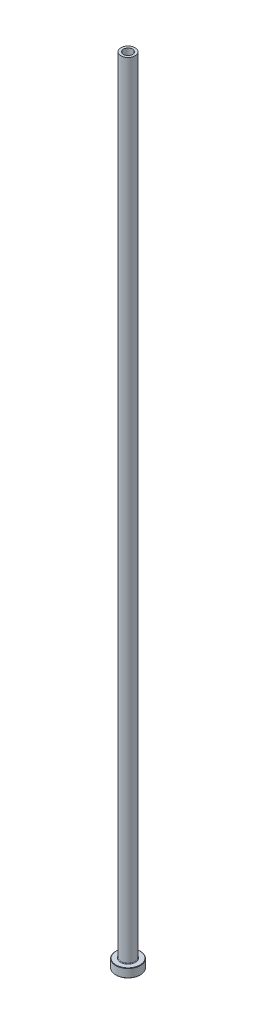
from build123d import *

# Parameters (mm, degrees)
FILLET1_R     = 0.3
CHAMFER1_SIZE = 0.2
CHAMFER3_SIZE = 0.5


with BuildPart() as part:
    # Sketch1 → Revolve1 (revolve)
    with BuildSketch(Plane.XY, mode=Mode.PRIVATE) as revolve1_sk:
        Polygon((-2.6, 450), (-4, 450), (-4, 5), (-7, 5), (-7, 0), (-2.85, 0), (-2.85, 393), (-2.6, 405), align=None)
    revolve(revolve1_sk.sketch.rotate(Axis((0, 92.187680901, 0), (0, -1, 0)), 270), axis=Axis((0, 92.187680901, 0), (0, -1, 0)))

    # Fillet1
    fillet1_edges = [part.edges().sort_by_distance(p)[0] for p in [
        (0, 5, -4),
    ]]
    fillet(fillet1_edges, radius=FILLET1_R)

    # Chamfer1
    chamfer1_edges = [part.edges().sort_by_distance(p)[0] for p in [
        (0, 0, -7),
        (0, 5, -7),
    ]]
    chamfer(chamfer1_edges, length=CHAMFER1_SIZE)

    # Chamfer3
    chamfer3_edges = [part.edges().sort_by_distance(p)[0] for p in [
        (0, 0, -2.85),
    ]]
    chamfer(chamfer3_edges, length=CHAMFER3_SIZE)


solid = part.part
